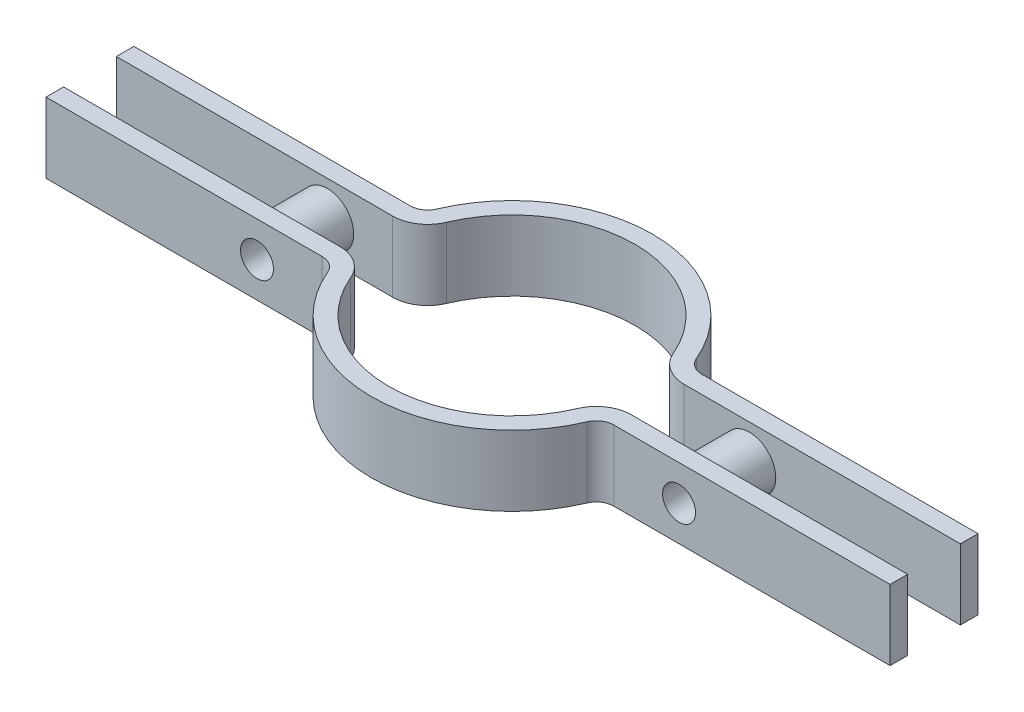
ISO-10303-21;
HEADER;
FILE_DESCRIPTION(('STEP AP214'),'2;1');
FILE_NAME('part.step','',(''),(''),'','','');
FILE_SCHEMA(('AUTOMOTIVE_DESIGN { 1 0 10303 214 1 1 1 1 }'));
ENDSEC;
DATA;
#1=APPLICATION_CONTEXT('core data for automotive mechanical design processes');
#2=APPLICATION_PROTOCOL_DEFINITION('international standard','automotive_design',2000,#1);
#3=PRODUCT_CONTEXT('',#1,'mechanical');
#4=PRODUCT('Part','Part','',(#3));
#5=PRODUCT_RELATED_PRODUCT_CATEGORY('part','',(#4));
#6=PRODUCT_DEFINITION_FORMATION('','',#4);
#7=PRODUCT_DEFINITION_CONTEXT('part definition',#1,'design');
#8=PRODUCT_DEFINITION('design','',#6,#7);
#9=PRODUCT_DEFINITION_SHAPE('','',#8);
#10=(LENGTH_UNIT() NAMED_UNIT(*) SI_UNIT(.MILLI.,.METRE.));
#11=(NAMED_UNIT(*) PLANE_ANGLE_UNIT() SI_UNIT($,.RADIAN.));
#12=(NAMED_UNIT(*) SI_UNIT($,.STERADIAN.) SOLID_ANGLE_UNIT());
#13=UNCERTAINTY_MEASURE_WITH_UNIT(LENGTH_MEASURE(1.E-05),#10,'distance_accuracy_value','');
#14=(GEOMETRIC_REPRESENTATION_CONTEXT(3) GLOBAL_UNCERTAINTY_ASSIGNED_CONTEXT((#13)) GLOBAL_UNIT_ASSIGNED_CONTEXT((#10,
#11,#12)) REPRESENTATION_CONTEXT('',''));
#15=CARTESIAN_POINT('',(0.,0.,0.));
#16=DIRECTION('',(0.,0.,1.));
#17=DIRECTION('',(1.,0.,0.));
#18=AXIS2_PLACEMENT_3D('',#15,#16,#17);
#19=CARTESIAN_POINT('',(52.651418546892,25.4,-9.525));
#20=DIRECTION('',(0.,0.,-1.));
#21=DIRECTION('',(-1.,0.,0.));
#22=AXIS2_PLACEMENT_3D('',#19,#20,#21);
#23=PLANE('',#22);
#24=DIRECTION('',(1.,0.,0.));
#25=VECTOR('',#24,1.);
#26=CARTESIAN_POINT('',(52.651418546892,0.,-9.525));
#27=LINE('',#26,#25);
#28=CARTESIAN_POINT('',(52.651418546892,0.,-9.52500000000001));
#29=VERTEX_POINT('',#28);
#30=CARTESIAN_POINT('',(152.4,0.,-9.525));
#31=VERTEX_POINT('',#30);
#32=EDGE_CURVE('E161',#29,#31,#27,.T.);
#33=ORIENTED_EDGE('',*,*,#32,.T.);
#34=DIRECTION('',(0.,-1.,0.));
#35=VECTOR('',#34,1.);
#36=CARTESIAN_POINT('',(152.4,25.4,-9.525));
#37=LINE('',#36,#35);
#38=CARTESIAN_POINT('',(152.4,25.4,-9.525));
#39=VERTEX_POINT('',#38);
#40=EDGE_CURVE('E208',#39,#31,#37,.T.);
#41=ORIENTED_EDGE('',*,*,#40,.F.);
#42=DIRECTION('',(1.,0.,0.));
#43=VECTOR('',#42,1.);
#44=CARTESIAN_POINT('',(52.651418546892,25.4,-9.525));
#45=LINE('',#44,#43);
#46=CARTESIAN_POINT('',(52.651418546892,25.4,-9.52500000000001));
#47=VERTEX_POINT('',#46);
#48=EDGE_CURVE('E106',#47,#39,#45,.T.);
#49=ORIENTED_EDGE('',*,*,#48,.F.);
#50=DIRECTION('',(0.,-1.,0.));
#51=VECTOR('',#50,1.);
#52=CARTESIAN_POINT('',(52.651418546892,25.4,-9.52500000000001));
#53=LINE('',#52,#51);
#54=EDGE_CURVE('E157',#47,#29,#53,.T.);
#55=ORIENTED_EDGE('',*,*,#54,.T.);
#56=EDGE_LOOP('',(#33,#41,#49,#55));
#57=FACE_BOUND('',#56,.T.);
#58=CARTESIAN_POINT('',(76.2,12.7,-9.525));
#59=DIRECTION('',(0.,0.,-1.));
#60=DIRECTION('',(-1.,0.,0.));
#61=AXIS2_PLACEMENT_3D('',#58,#59,#60);
#62=CIRCLE('',#61,9.52500000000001);
#63=CARTESIAN_POINT('',(85.725,12.7,-9.52499999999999));
#64=VERTEX_POINT('',#63);
#65=EDGE_CURVE('E11',#64,#64,#62,.F.);
#66=ORIENTED_EDGE('',*,*,#65,.F.);
#67=EDGE_LOOP('',(#66));
#68=FACE_BOUND('',#67,.T.);
#69=ADVANCED_FACE('F34',(#57,#68),#23,.F.);
#70=CARTESIAN_POINT('',(52.651418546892,25.4,9.525));
#71=DIRECTION('',(0.,0.,1.));
#72=DIRECTION('',(-1.,0.,0.));
#73=AXIS2_PLACEMENT_3D('',#70,#71,#72);
#74=PLANE('',#73);
#75=DIRECTION('',(1.,0.,0.));
#76=VECTOR('',#75,1.);
#77=CARTESIAN_POINT('',(52.651418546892,0.,9.525));
#78=LINE('',#77,#76);
#79=CARTESIAN_POINT('',(52.651418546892,0.,9.52500000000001));
#80=VERTEX_POINT('',#79);
#81=CARTESIAN_POINT('',(152.4,0.,9.525));
#82=VERTEX_POINT('',#81);
#83=EDGE_CURVE('E475',#80,#82,#78,.T.);
#84=ORIENTED_EDGE('',*,*,#83,.F.);
#85=DIRECTION('',(0.,-1.,0.));
#86=VECTOR('',#85,1.);
#87=CARTESIAN_POINT('',(52.651418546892,25.4,9.52500000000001));
#88=LINE('',#87,#86);
#89=CARTESIAN_POINT('',(52.651418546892,25.4,9.52500000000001));
#90=VERTEX_POINT('',#89);
#91=EDGE_CURVE('E513',#90,#80,#88,.T.);
#92=ORIENTED_EDGE('',*,*,#91,.F.);
#93=DIRECTION('',(1.,0.,0.));
#94=VECTOR('',#93,1.);
#95=CARTESIAN_POINT('',(52.651418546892,25.4,9.525));
#96=LINE('',#95,#94);
#97=CARTESIAN_POINT('',(152.4,25.4,9.525));
#98=VERTEX_POINT('',#97);
#99=EDGE_CURVE('E477',#90,#98,#96,.T.);
#100=ORIENTED_EDGE('',*,*,#99,.T.);
#101=DIRECTION('',(0.,-1.,0.));
#102=VECTOR('',#101,1.);
#103=CARTESIAN_POINT('',(152.4,25.4,9.525));
#104=LINE('',#103,#102);
#105=EDGE_CURVE('E213',#98,#82,#104,.T.);
#106=ORIENTED_EDGE('',*,*,#105,.T.);
#107=EDGE_LOOP('',(#84,#92,#100,#106));
#108=FACE_BOUND('',#107,.T.);
#109=CARTESIAN_POINT('',(76.2,12.7,9.525));
#110=DIRECTION('',(0.,0.,1.));
#111=DIRECTION('',(1.,0.,0.));
#112=AXIS2_PLACEMENT_3D('',#109,#110,#111);
#113=CIRCLE('',#112,9.52500000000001);
#114=CARTESIAN_POINT('',(85.725,12.7,9.52499999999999));
#115=VERTEX_POINT('',#114);
#116=EDGE_CURVE('E43',#115,#115,#113,.F.);
#117=ORIENTED_EDGE('',*,*,#116,.F.);
#118=EDGE_LOOP('',(#117));
#119=FACE_BOUND('',#118,.T.);
#120=ADVANCED_FACE('F276',(#108,#119),#74,.F.);
#121=CARTESIAN_POINT('',(-76.2,12.7,-42.8157683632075));
#122=DIRECTION('',(0.,0.,1.));
#123=DIRECTION('',(1.,0.,0.));
#124=AXIS2_PLACEMENT_3D('',#121,#122,#123);
#125=CYLINDRICAL_SURFACE('',#124,9.52500000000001);
#126=CARTESIAN_POINT('',(-76.2,12.7,-9.525));
#127=DIRECTION('',(0.,0.,-1.));
#128=DIRECTION('',(-1.,0.,0.));
#129=AXIS2_PLACEMENT_3D('',#126,#127,#128);
#130=CIRCLE('',#129,9.52500000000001);
#131=CARTESIAN_POINT('',(-66.675,12.7,-9.52500000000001));
#132=VERTEX_POINT('',#131);
#133=EDGE_CURVE('E165',#132,#132,#130,.T.);
#134=CARTESIAN_POINT('',(-76.2,12.7,9.525));
#135=DIRECTION('',(0.,0.,1.));
#136=DIRECTION('',(1.,0.,0.));
#137=AXIS2_PLACEMENT_3D('',#134,#135,#136);
#138=CIRCLE('',#137,9.52500000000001);
#139=CARTESIAN_POINT('',(-66.675,12.7,9.52500000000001));
#140=VERTEX_POINT('',#139);
#141=EDGE_CURVE('E37',#140,#140,#138,.F.);
#142=CARTESIAN_POINT('',(-66.675,12.7,-9.52500000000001));
#143=CARTESIAN_POINT('',(-66.675,12.7,-9.3265625));
#144=CARTESIAN_POINT('',(-66.675,12.7,-9.12812500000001));
#145=CARTESIAN_POINT('',(-66.675,12.7,-8.73125));
#146=CARTESIAN_POINT('',(-66.675,12.7,-8.53281250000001));
#147=CARTESIAN_POINT('',(-66.675,12.7,-8.1359375));
#148=CARTESIAN_POINT('',(-66.675,12.7,-7.93750000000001));
#149=CARTESIAN_POINT('',(-66.675,12.7,-7.540625));
#150=CARTESIAN_POINT('',(-66.675,12.7,-7.3421875));
#151=CARTESIAN_POINT('',(-66.675,12.7,-6.9453125));
#152=CARTESIAN_POINT('',(-66.675,12.7,-6.746875));
#153=CARTESIAN_POINT('',(-66.675,12.7,-6.35));
#154=CARTESIAN_POINT('',(-66.675,12.7,-6.1515625));
#155=CARTESIAN_POINT('',(-66.675,12.7,-5.7546875));
#156=CARTESIAN_POINT('',(-66.675,12.7,-5.55625));
#157=CARTESIAN_POINT('',(-66.675,12.7,-5.159375));
#158=CARTESIAN_POINT('',(-66.675,12.7,-4.9609375));
#159=CARTESIAN_POINT('',(-66.675,12.7,-4.5640625));
#160=CARTESIAN_POINT('',(-66.675,12.7,-4.365625));
#161=CARTESIAN_POINT('',(-66.675,12.7,-3.96875));
#162=CARTESIAN_POINT('',(-66.675,12.7,-3.7703125));
#163=CARTESIAN_POINT('',(-66.675,12.7,-3.3734375));
#164=CARTESIAN_POINT('',(-66.675,12.7,-3.175));
#165=CARTESIAN_POINT('',(-66.675,12.7,-2.778125));
#166=CARTESIAN_POINT('',(-66.675,12.7,-2.5796875));
#167=CARTESIAN_POINT('',(-66.675,12.7,-2.1828125));
#168=CARTESIAN_POINT('',(-66.675,12.7,-1.984375));
#169=CARTESIAN_POINT('',(-66.675,12.7,-1.5875));
#170=CARTESIAN_POINT('',(-66.675,12.7,-1.3890625));
#171=CARTESIAN_POINT('',(-66.675,12.7,-0.992187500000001));
#172=CARTESIAN_POINT('',(-66.675,12.7,-0.793750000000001));
#173=CARTESIAN_POINT('',(-66.675,12.7,-0.396875));
#174=CARTESIAN_POINT('',(-66.675,12.7,-0.1984375));
#175=CARTESIAN_POINT('',(-66.675,12.7,0.1984375));
#176=CARTESIAN_POINT('',(-66.675,12.7,0.396875));
#177=CARTESIAN_POINT('',(-66.675,12.7,0.793750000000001));
#178=CARTESIAN_POINT('',(-66.675,12.7,0.992187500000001));
#179=CARTESIAN_POINT('',(-66.675,12.7,1.3890625));
#180=CARTESIAN_POINT('',(-66.675,12.7,1.5875));
#181=CARTESIAN_POINT('',(-66.675,12.7,1.984375));
#182=CARTESIAN_POINT('',(-66.675,12.7,2.1828125));
#183=CARTESIAN_POINT('',(-66.675,12.7,2.5796875));
#184=CARTESIAN_POINT('',(-66.675,12.7,2.778125));
#185=CARTESIAN_POINT('',(-66.675,12.7,3.175));
#186=CARTESIAN_POINT('',(-66.675,12.7,3.3734375));
#187=CARTESIAN_POINT('',(-66.675,12.7,3.7703125));
#188=CARTESIAN_POINT('',(-66.675,12.7,3.96875));
#189=CARTESIAN_POINT('',(-66.675,12.7,4.365625));
#190=CARTESIAN_POINT('',(-66.675,12.7,4.5640625));
#191=CARTESIAN_POINT('',(-66.675,12.7,4.9609375));
#192=CARTESIAN_POINT('',(-66.675,12.7,5.159375));
#193=CARTESIAN_POINT('',(-66.675,12.7,5.55625));
#194=CARTESIAN_POINT('',(-66.675,12.7,5.7546875));
#195=CARTESIAN_POINT('',(-66.675,12.7,6.1515625));
#196=CARTESIAN_POINT('',(-66.675,12.7,6.35));
#197=CARTESIAN_POINT('',(-66.675,12.7,6.746875));
#198=CARTESIAN_POINT('',(-66.675,12.7,6.9453125));
#199=CARTESIAN_POINT('',(-66.675,12.7,7.3421875));
#200=CARTESIAN_POINT('',(-66.675,12.7,7.540625));
#201=CARTESIAN_POINT('',(-66.675,12.7,7.93750000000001));
#202=CARTESIAN_POINT('',(-66.675,12.7,8.1359375));
#203=CARTESIAN_POINT('',(-66.675,12.7,8.53281250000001));
#204=CARTESIAN_POINT('',(-66.675,12.7,8.73125));
#205=CARTESIAN_POINT('',(-66.675,12.7,9.12812500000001));
#206=CARTESIAN_POINT('',(-66.675,12.7,9.3265625));
#207=CARTESIAN_POINT('',(-66.675,12.7,9.52500000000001));
#208=B_SPLINE_CURVE_WITH_KNOTS('',3,(#142,#143,#144,#145,#146,#147,#148,#149,#150,#151,#152,
#153,#154,#155,#156,#157,#158,#159,#160,#161,#162,#163,#164,#165,#166,#167,#168,#169,#170,#171,
#172,#173,#174,#175,#176,#177,#178,#179,#180,#181,#182,#183,#184,#185,#186,#187,#188,#189,#190,
#191,#192,#193,#194,#195,#196,#197,#198,#199,#200,#201,#202,#203,#204,#205,#206,#207),
.UNSPECIFIED.,.F.,.F.,(4,2,2,2,2,2,2,2,2,2,2,2,2,2,2,2,2,2,2,2,2,2,2,2,2,2,2,2,2,2,2,2,4),(0.,
0.5953125,1.190625,1.7859375,2.38125,2.9765625,3.571875,4.1671875,4.7625,5.3578125,5.953125,
6.5484375,7.14375,7.7390625,8.334375,8.92968750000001,9.52500000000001,10.1203125,10.715625,
11.3109375,11.90625,12.5015625,13.096875,13.6921875,14.2875,14.8828125,15.478125,16.0734375,
16.66875,17.2640625,17.859375,18.4546875,19.05),.UNSPECIFIED.);
#209=EDGE_CURVE('BSEAM281',#132,#140,#208,.T.);
#210=ORIENTED_EDGE('',*,*,#133,.F.);
#211=ORIENTED_EDGE('',*,*,#141,.T.);
#212=ORIENTED_EDGE('',*,*,#209,.T.);
#213=ORIENTED_EDGE('',*,*,#209,.F.);
#214=EDGE_LOOP('',(#210,#212,#211,#213));
#215=FACE_BOUND('',#214,.T.);
#216=ADVANCED_FACE('F281',(#215),#125,.T.);
#217=CARTESIAN_POINT('',(152.4,25.4,-15.875));
#218=DIRECTION('',(1.,0.,0.));
#219=DIRECTION('',(0.,0.,-1.));
#220=AXIS2_PLACEMENT_3D('',#217,#218,#219);
#221=PLANE('',#220);
#222=DIRECTION('',(0.,0.,1.));
#223=VECTOR('',#222,1.);
#224=CARTESIAN_POINT('',(152.4,0.,-15.875));
#225=LINE('',#224,#223);
#226=CARTESIAN_POINT('',(152.4,0.,-15.875));
#227=VERTEX_POINT('',#226);
#228=EDGE_CURVE('E164',#227,#31,#225,.T.);
#229=ORIENTED_EDGE('',*,*,#228,.F.);
#230=DIRECTION('',(0.,-1.,0.));
#231=VECTOR('',#230,1.);
#232=CARTESIAN_POINT('',(152.4,25.4,-15.875));
#233=LINE('',#232,#231);
#234=CARTESIAN_POINT('',(152.4,25.4,-15.875));
#235=VERTEX_POINT('',#234);
#236=EDGE_CURVE('E206',#235,#227,#233,.T.);
#237=ORIENTED_EDGE('',*,*,#236,.F.);
#238=DIRECTION('',(0.,0.,1.));
#239=VECTOR('',#238,1.);
#240=CARTESIAN_POINT('',(152.4,25.4,-15.875));
#241=LINE('',#240,#239);
#242=EDGE_CURVE('E231',#235,#39,#241,.T.);
#243=ORIENTED_EDGE('',*,*,#242,.T.);
#244=ORIENTED_EDGE('',*,*,#40,.T.);
#245=EDGE_LOOP('',(#229,#237,#243,#244));
#246=FACE_BOUND('',#245,.T.);
#247=ADVANCED_FACE('F354',(#246),#221,.T.);
#248=CARTESIAN_POINT('',(52.651418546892,25.4,-15.875));
#249=DIRECTION('',(0.,0.,-1.));
#250=DIRECTION('',(-1.,0.,0.));
#251=AXIS2_PLACEMENT_3D('',#248,#249,#250);
#252=PLANE('',#251);
#253=CARTESIAN_POINT('',(76.2,12.7,-15.875));
#254=DIRECTION('',(0.,0.,-1.));
#255=DIRECTION('',(-1.,0.,0.));
#256=AXIS2_PLACEMENT_3D('',#253,#254,#255);
#257=CIRCLE('',#256,5.95248999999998);
#258=CARTESIAN_POINT('',(70.24751,12.7,-15.875));
#259=VERTEX_POINT('',#258);
#260=EDGE_CURVE('E472',#259,#259,#257,.T.);
#261=ORIENTED_EDGE('',*,*,#260,.F.);
#262=EDGE_LOOP('',(#261));
#263=FACE_BOUND('',#262,.T.);
#264=DIRECTION('',(1.,0.,0.));
#265=VECTOR('',#264,1.);
#266=CARTESIAN_POINT('',(52.651418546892,0.,-15.875));
#267=LINE('',#266,#265);
#268=CARTESIAN_POINT('',(52.651418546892,0.,-15.875));
#269=VERTEX_POINT('',#268);
#270=EDGE_CURVE('E168',#269,#227,#267,.T.);
#271=ORIENTED_EDGE('',*,*,#270,.F.);
#272=DIRECTION('',(0.,-1.,0.));
#273=VECTOR('',#272,1.);
#274=CARTESIAN_POINT('',(52.651418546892,25.4,-15.875));
#275=LINE('',#274,#273);
#276=CARTESIAN_POINT('',(52.651418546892,25.4,-15.875));
#277=VERTEX_POINT('',#276);
#278=EDGE_CURVE('E204',#277,#269,#275,.T.);
#279=ORIENTED_EDGE('',*,*,#278,.F.);
#280=DIRECTION('',(1.,0.,0.));
#281=VECTOR('',#280,1.);
#282=CARTESIAN_POINT('',(52.651418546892,25.4,-15.875));
#283=LINE('',#282,#281);
#284=EDGE_CURVE('E234',#277,#235,#283,.T.);
#285=ORIENTED_EDGE('',*,*,#284,.T.);
#286=ORIENTED_EDGE('',*,*,#236,.T.);
#287=EDGE_LOOP('',(#271,#279,#285,#286));
#288=FACE_BOUND('',#287,.T.);
#289=ADVANCED_FACE('F658',(#263,#288),#252,.T.);
#290=CARTESIAN_POINT('',(52.651418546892,25.4,-22.225));
#291=DIRECTION('',(0.,-1.,0.));
#292=DIRECTION('',(0.,0.,-1.));
#293=AXIS2_PLACEMENT_3D('',#290,#291,#292);
#294=CYLINDRICAL_SURFACE('',#293,6.35);
#295=CARTESIAN_POINT('',(52.651418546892,0.,-22.225));
#296=DIRECTION('',(0.,1.,0.));
#297=DIRECTION('',(1.,0.,0.));
#298=AXIS2_PLACEMENT_3D('',#295,#296,#297);
#299=CIRCLE('',#298,6.35);
#300=CARTESIAN_POINT('',(46.8012609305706,0.,-19.7555555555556));
#301=VERTEX_POINT('',#300);
#302=EDGE_CURVE('E171',#301,#269,#299,.T.);
#303=ORIENTED_EDGE('',*,*,#302,.F.);
#304=DIRECTION('',(0.,-1.,0.));
#305=VECTOR('',#304,1.);
#306=CARTESIAN_POINT('',(46.8012609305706,25.4,-19.7555555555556));
#307=LINE('',#306,#305);
#308=CARTESIAN_POINT('',(46.8012609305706,25.4,-19.7555555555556));
#309=VERTEX_POINT('',#308);
#310=EDGE_CURVE('E202',#309,#301,#307,.T.);
#311=ORIENTED_EDGE('',*,*,#310,.F.);
#312=CARTESIAN_POINT('',(52.651418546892,25.4,-22.225));
#313=DIRECTION('',(0.,1.,0.));
#314=DIRECTION('',(1.,0.,0.));
#315=AXIS2_PLACEMENT_3D('',#312,#313,#314);
#316=CIRCLE('',#315,6.35);
#317=EDGE_CURVE('E237',#309,#277,#316,.T.);
#318=ORIENTED_EDGE('',*,*,#317,.T.);
#319=ORIENTED_EDGE('',*,*,#278,.T.);
#320=EDGE_LOOP('',(#303,#311,#318,#319));
#321=FACE_BOUND('',#320,.T.);
#322=ADVANCED_FACE('F661',(#321),#294,.F.);
#323=CARTESIAN_POINT('',(0.,25.4,0.));
#324=DIRECTION('',(0.,-1.,0.));
#325=DIRECTION('',(0.,0.,-1.));
#326=AXIS2_PLACEMENT_3D('',#323,#324,#325);
#327=CYLINDRICAL_SURFACE('',#326,50.8);
#328=CARTESIAN_POINT('',(0.,0.,0.));
#329=DIRECTION('',(0.,1.,0.));
#330=DIRECTION('',(1.,0.,0.));
#331=AXIS2_PLACEMENT_3D('',#328,#329,#330);
#332=CIRCLE('',#331,50.8);
#333=CARTESIAN_POINT('',(-46.8012609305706,0.,-19.7555555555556));
#334=VERTEX_POINT('',#333);
#335=EDGE_CURVE('E174',#334,#301,#332,.F.);
#336=ORIENTED_EDGE('',*,*,#335,.F.);
#337=DIRECTION('',(0.,-1.,0.));
#338=VECTOR('',#337,1.);
#339=CARTESIAN_POINT('',(-46.8012609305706,25.4,-19.7555555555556));
#340=LINE('',#339,#338);
#341=CARTESIAN_POINT('',(-46.8012609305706,25.4,-19.7555555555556));
#342=VERTEX_POINT('',#341);
#343=EDGE_CURVE('E200',#342,#334,#340,.T.);
#344=ORIENTED_EDGE('',*,*,#343,.F.);
#345=CARTESIAN_POINT('',(0.,25.4,0.));
#346=DIRECTION('',(0.,1.,0.));
#347=DIRECTION('',(1.,0.,0.));
#348=AXIS2_PLACEMENT_3D('',#345,#346,#347);
#349=CIRCLE('',#348,50.8);
#350=EDGE_CURVE('E240',#342,#309,#349,.F.);
#351=ORIENTED_EDGE('',*,*,#350,.T.);
#352=ORIENTED_EDGE('',*,*,#310,.T.);
#353=EDGE_LOOP('',(#336,#344,#351,#352));
#354=FACE_BOUND('',#353,.T.);
#355=ADVANCED_FACE('F671',(#354),#327,.T.);
#356=CARTESIAN_POINT('',(-52.651418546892,25.4,-22.225));
#357=DIRECTION('',(0.,-1.,0.));
#358=DIRECTION('',(0.,0.,-1.));
#359=AXIS2_PLACEMENT_3D('',#356,#357,#358);
#360=CYLINDRICAL_SURFACE('',#359,6.35);
#361=CARTESIAN_POINT('',(-52.651418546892,0.,-22.225));
#362=DIRECTION('',(0.,1.,0.));
#363=DIRECTION('',(1.,0.,0.));
#364=AXIS2_PLACEMENT_3D('',#361,#362,#363);
#365=CIRCLE('',#364,6.35);
#366=CARTESIAN_POINT('',(-52.651418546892,0.,-15.875));
#367=VERTEX_POINT('',#366);
#368=EDGE_CURVE('E177',#367,#334,#365,.T.);
#369=ORIENTED_EDGE('',*,*,#368,.F.);
#370=DIRECTION('',(0.,-1.,0.));
#371=VECTOR('',#370,1.);
#372=CARTESIAN_POINT('',(-52.651418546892,25.4,-15.875));
#373=LINE('',#372,#371);
#374=CARTESIAN_POINT('',(-52.651418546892,25.4,-15.875));
#375=VERTEX_POINT('',#374);
#376=EDGE_CURVE('E198',#375,#367,#373,.T.);
#377=ORIENTED_EDGE('',*,*,#376,.F.);
#378=CARTESIAN_POINT('',(-52.651418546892,25.4,-22.225));
#379=DIRECTION('',(0.,1.,0.));
#380=DIRECTION('',(1.,0.,0.));
#381=AXIS2_PLACEMENT_3D('',#378,#379,#380);
#382=CIRCLE('',#381,6.35);
#383=EDGE_CURVE('E243',#375,#342,#382,.T.);
#384=ORIENTED_EDGE('',*,*,#383,.T.);
#385=ORIENTED_EDGE('',*,*,#343,.T.);
#386=EDGE_LOOP('',(#369,#377,#384,#385));
#387=FACE_BOUND('',#386,.T.);
#388=ADVANCED_FACE('F673',(#387),#360,.F.);
#389=CARTESIAN_POINT('',(-152.4,25.4,-15.875));
#390=DIRECTION('',(0.,0.,-1.));
#391=DIRECTION('',(-1.,0.,0.));
#392=AXIS2_PLACEMENT_3D('',#389,#390,#391);
#393=PLANE('',#392);
#394=CARTESIAN_POINT('',(-76.2,12.7,-15.875));
#395=DIRECTION('',(0.,0.,-1.));
#396=DIRECTION('',(-1.,0.,0.));
#397=AXIS2_PLACEMENT_3D('',#394,#395,#396);
#398=CIRCLE('',#397,5.95248999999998);
#399=CARTESIAN_POINT('',(-82.15249,12.7,-15.875));
#400=VERTEX_POINT('',#399);
#401=EDGE_CURVE('E462',#400,#400,#398,.T.);
#402=ORIENTED_EDGE('',*,*,#401,.F.);
#403=EDGE_LOOP('',(#402));
#404=FACE_BOUND('',#403,.T.);
#405=DIRECTION('',(1.,0.,0.));
#406=VECTOR('',#405,1.);
#407=CARTESIAN_POINT('',(-152.4,0.,-15.875));
#408=LINE('',#407,#406);
#409=CARTESIAN_POINT('',(-152.4,0.,-15.875));
#410=VERTEX_POINT('',#409);
#411=EDGE_CURVE('E180',#410,#367,#408,.T.);
#412=ORIENTED_EDGE('',*,*,#411,.F.);
#413=DIRECTION('',(0.,-1.,0.));
#414=VECTOR('',#413,1.);
#415=CARTESIAN_POINT('',(-152.4,25.4,-15.875));
#416=LINE('',#415,#414);
#417=CARTESIAN_POINT('',(-152.4,25.4,-15.875));
#418=VERTEX_POINT('',#417);
#419=EDGE_CURVE('E196',#418,#410,#416,.T.);
#420=ORIENTED_EDGE('',*,*,#419,.F.);
#421=DIRECTION('',(1.,0.,0.));
#422=VECTOR('',#421,1.);
#423=CARTESIAN_POINT('',(-152.4,25.4,-15.875));
#424=LINE('',#423,#422);
#425=EDGE_CURVE('E246',#418,#375,#424,.T.);
#426=ORIENTED_EDGE('',*,*,#425,.T.);
#427=ORIENTED_EDGE('',*,*,#376,.T.);
#428=EDGE_LOOP('',(#412,#420,#426,#427));
#429=FACE_BOUND('',#428,.T.);
#430=ADVANCED_FACE('F259',(#404,#429),#393,.T.);
#431=CARTESIAN_POINT('',(-152.4,25.4,-9.525));
#432=DIRECTION('',(-1.,0.,0.));
#433=DIRECTION('',(0.,0.,1.));
#434=AXIS2_PLACEMENT_3D('',#431,#432,#433);
#435=PLANE('',#434);
#436=DIRECTION('',(0.,0.,-1.));
#437=VECTOR('',#436,1.);
#438=CARTESIAN_POINT('',(-152.4,0.,-9.525));
#439=LINE('',#438,#437);
#440=CARTESIAN_POINT('',(-152.4,0.,-9.525));
#441=VERTEX_POINT('',#440);
#442=EDGE_CURVE('E183',#441,#410,#439,.T.);
#443=ORIENTED_EDGE('',*,*,#442,.F.);
#444=DIRECTION('',(0.,-1.,0.));
#445=VECTOR('',#444,1.);
#446=CARTESIAN_POINT('',(-152.4,25.4,-9.525));
#447=LINE('',#446,#445);
#448=CARTESIAN_POINT('',(-152.4,25.4,-9.525));
#449=VERTEX_POINT('',#448);
#450=EDGE_CURVE('E194',#449,#441,#447,.T.);
#451=ORIENTED_EDGE('',*,*,#450,.F.);
#452=DIRECTION('',(0.,0.,-1.));
#453=VECTOR('',#452,1.);
#454=CARTESIAN_POINT('',(-152.4,25.4,-9.525));
#455=LINE('',#454,#453);
#456=EDGE_CURVE('E249',#449,#418,#455,.T.);
#457=ORIENTED_EDGE('',*,*,#456,.T.);
#458=ORIENTED_EDGE('',*,*,#419,.T.);
#459=EDGE_LOOP('',(#443,#451,#457,#458));
#460=FACE_BOUND('',#459,.T.);
#461=ADVANCED_FACE('F253',(#460),#435,.T.);
#462=CARTESIAN_POINT('',(-152.4,25.4,-9.525));
#463=DIRECTION('',(0.,0.,-1.));
#464=DIRECTION('',(-1.,0.,0.));
#465=AXIS2_PLACEMENT_3D('',#462,#463,#464);
#466=PLANE('',#465);
#467=ORIENTED_EDGE('',*,*,#133,.T.);
#468=EDGE_LOOP('',(#467));
#469=FACE_BOUND('',#468,.T.);
#470=DIRECTION('',(1.,0.,0.));
#471=VECTOR('',#470,1.);
#472=CARTESIAN_POINT('',(-152.4,0.,-9.525));
#473=LINE('',#472,#471);
#474=CARTESIAN_POINT('',(-52.651418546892,0.,-9.525));
#475=VERTEX_POINT('',#474);
#476=EDGE_CURVE('E186',#441,#475,#473,.T.);
#477=ORIENTED_EDGE('',*,*,#476,.T.);
#478=DIRECTION('',(0.,-1.,0.));
#479=VECTOR('',#478,1.);
#480=CARTESIAN_POINT('',(-52.651418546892,25.4,-9.525));
#481=LINE('',#480,#479);
#482=CARTESIAN_POINT('',(-52.651418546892,25.4,-9.525));
#483=VERTEX_POINT('',#482);
#484=EDGE_CURVE('E152',#483,#475,#481,.T.);
#485=ORIENTED_EDGE('',*,*,#484,.F.);
#486=DIRECTION('',(1.,0.,0.));
#487=VECTOR('',#486,1.);
#488=CARTESIAN_POINT('',(-152.4,25.4,-9.525));
#489=LINE('',#488,#487);
#490=EDGE_CURVE('E143',#449,#483,#489,.T.);
#491=ORIENTED_EDGE('',*,*,#490,.F.);
#492=ORIENTED_EDGE('',*,*,#450,.T.);
#493=EDGE_LOOP('',(#477,#485,#491,#492));
#494=FACE_BOUND('',#493,.T.);
#495=ADVANCED_FACE('F266',(#469,#494),#466,.F.);
#496=CARTESIAN_POINT('',(-52.651418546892,25.4,-22.225));
#497=DIRECTION('',(0.,-1.,0.));
#498=DIRECTION('',(0.,0.,-1.));
#499=AXIS2_PLACEMENT_3D('',#496,#497,#498);
#500=CYLINDRICAL_SURFACE('',#499,12.7);
#501=CARTESIAN_POINT('',(-52.651418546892,0.,-22.225));
#502=DIRECTION('',(0.,1.,0.));
#503=DIRECTION('',(0.,0.,1.));
#504=AXIS2_PLACEMENT_3D('',#501,#502,#503);
#505=CIRCLE('',#504,12.7);
#506=CARTESIAN_POINT('',(-40.9511033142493,0.,-17.2861111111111));
#507=VERTEX_POINT('',#506);
#508=EDGE_CURVE('E151',#475,#507,#505,.T.);
#509=ORIENTED_EDGE('',*,*,#508,.T.);
#510=DIRECTION('',(0.,-1.,0.));
#511=VECTOR('',#510,1.);
#512=CARTESIAN_POINT('',(-40.9511033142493,25.4,-17.2861111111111));
#513=LINE('',#512,#511);
#514=CARTESIAN_POINT('',(-40.9511033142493,25.4,-17.2861111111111));
#515=VERTEX_POINT('',#514);
#516=EDGE_CURVE('E148',#515,#507,#513,.T.);
#517=ORIENTED_EDGE('',*,*,#516,.F.);
#518=CARTESIAN_POINT('',(-52.651418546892,25.4,-22.225));
#519=DIRECTION('',(0.,1.,0.));
#520=DIRECTION('',(0.,0.,1.));
#521=AXIS2_PLACEMENT_3D('',#518,#519,#520);
#522=CIRCLE('',#521,12.7);
#523=EDGE_CURVE('E136',#483,#515,#522,.T.);
#524=ORIENTED_EDGE('',*,*,#523,.F.);
#525=ORIENTED_EDGE('',*,*,#484,.T.);
#526=EDGE_LOOP('',(#509,#517,#524,#525));
#527=FACE_BOUND('',#526,.T.);
#528=ADVANCED_FACE('F149',(#527),#500,.T.);
#529=CARTESIAN_POINT('',(0.,25.4,0.));
#530=DIRECTION('',(0.,-1.,0.));
#531=DIRECTION('',(0.,0.,-1.));
#532=AXIS2_PLACEMENT_3D('',#529,#530,#531);
#533=CYLINDRICAL_SURFACE('',#532,44.45);
#534=CARTESIAN_POINT('',(0.,0.,0.));
#535=DIRECTION('',(0.,-1.,0.));
#536=DIRECTION('',(0.,0.,1.));
#537=AXIS2_PLACEMENT_3D('',#534,#535,#536);
#538=CIRCLE('',#537,44.45);
#539=CARTESIAN_POINT('',(40.9511033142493,0.,-17.2861111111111));
#540=VERTEX_POINT('',#539);
#541=EDGE_CURVE('E94',#507,#540,#538,.T.);
#542=ORIENTED_EDGE('',*,*,#541,.T.);
#543=DIRECTION('',(0.,-1.,0.));
#544=VECTOR('',#543,1.);
#545=CARTESIAN_POINT('',(40.9511033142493,25.4,-17.2861111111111));
#546=LINE('',#545,#544);
#547=CARTESIAN_POINT('',(40.9511033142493,25.4,-17.2861111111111));
#548=VERTEX_POINT('',#547);
#549=EDGE_CURVE('E153',#548,#540,#546,.T.);
#550=ORIENTED_EDGE('',*,*,#549,.F.);
#551=CARTESIAN_POINT('',(0.,25.4,0.));
#552=DIRECTION('',(0.,-1.,0.));
#553=DIRECTION('',(0.,0.,1.));
#554=AXIS2_PLACEMENT_3D('',#551,#552,#553);
#555=CIRCLE('',#554,44.45);
#556=EDGE_CURVE('E140',#515,#548,#555,.T.);
#557=ORIENTED_EDGE('',*,*,#556,.F.);
#558=ORIENTED_EDGE('',*,*,#516,.T.);
#559=EDGE_LOOP('',(#542,#550,#557,#558));
#560=FACE_BOUND('',#559,.T.);
#561=ADVANCED_FACE('F155',(#560),#533,.F.);
#562=CARTESIAN_POINT('',(52.651418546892,25.4,-22.225));
#563=DIRECTION('',(0.,-1.,0.));
#564=DIRECTION('',(0.,0.,-1.));
#565=AXIS2_PLACEMENT_3D('',#562,#563,#564);
#566=CYLINDRICAL_SURFACE('',#565,12.7);
#567=CARTESIAN_POINT('',(52.651418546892,0.,-22.225));
#568=DIRECTION('',(0.,1.,0.));
#569=DIRECTION('',(0.,0.,-1.));
#570=AXIS2_PLACEMENT_3D('',#567,#568,#569);
#571=CIRCLE('',#570,12.7);
#572=EDGE_CURVE('E100',#540,#29,#571,.T.);
#573=ORIENTED_EDGE('',*,*,#572,.T.);
#574=ORIENTED_EDGE('',*,*,#54,.F.);
#575=CARTESIAN_POINT('',(52.651418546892,25.4,-22.225));
#576=DIRECTION('',(0.,1.,0.));
#577=DIRECTION('',(0.,0.,-1.));
#578=AXIS2_PLACEMENT_3D('',#575,#576,#577);
#579=CIRCLE('',#578,12.7);
#580=EDGE_CURVE('E52',#548,#47,#579,.T.);
#581=ORIENTED_EDGE('',*,*,#580,.F.);
#582=ORIENTED_EDGE('',*,*,#549,.T.);
#583=EDGE_LOOP('',(#573,#574,#581,#582));
#584=FACE_BOUND('',#583,.T.);
#585=ADVANCED_FACE('F358',(#584),#566,.T.);
#586=CARTESIAN_POINT('',(52.651418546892,25.4,-22.225));
#587=DIRECTION('',(0.,1.,0.));
#588=DIRECTION('',(1.,0.,0.));
#589=AXIS2_PLACEMENT_3D('',#586,#587,#588);
#590=PLANE('',#589);
#591=ORIENTED_EDGE('',*,*,#48,.T.);
#592=ORIENTED_EDGE('',*,*,#242,.F.);
#593=ORIENTED_EDGE('',*,*,#284,.F.);
#594=ORIENTED_EDGE('',*,*,#317,.F.);
#595=ORIENTED_EDGE('',*,*,#350,.F.);
#596=ORIENTED_EDGE('',*,*,#383,.F.);
#597=ORIENTED_EDGE('',*,*,#425,.F.);
#598=ORIENTED_EDGE('',*,*,#456,.F.);
#599=ORIENTED_EDGE('',*,*,#490,.T.);
#600=ORIENTED_EDGE('',*,*,#523,.T.);
#601=ORIENTED_EDGE('',*,*,#556,.T.);
#602=ORIENTED_EDGE('',*,*,#580,.T.);
#603=EDGE_LOOP('',(#591,#592,#593,#594,#595,#596,#597,#598,#599,#600,#601,#602));
#604=FACE_BOUND('',#603,.T.);
#605=ADVANCED_FACE('F138',(#604),#590,.T.);
#606=CARTESIAN_POINT('',(52.651418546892,0.,-22.225));
#607=DIRECTION('',(0.,1.,0.));
#608=DIRECTION('',(1.,0.,0.));
#609=AXIS2_PLACEMENT_3D('',#606,#607,#608);
#610=PLANE('',#609);
#611=ORIENTED_EDGE('',*,*,#32,.F.);
#612=ORIENTED_EDGE('',*,*,#572,.F.);
#613=ORIENTED_EDGE('',*,*,#541,.F.);
#614=ORIENTED_EDGE('',*,*,#508,.F.);
#615=ORIENTED_EDGE('',*,*,#476,.F.);
#616=ORIENTED_EDGE('',*,*,#442,.T.);
#617=ORIENTED_EDGE('',*,*,#411,.T.);
#618=ORIENTED_EDGE('',*,*,#368,.T.);
#619=ORIENTED_EDGE('',*,*,#335,.T.);
#620=ORIENTED_EDGE('',*,*,#302,.T.);
#621=ORIENTED_EDGE('',*,*,#270,.T.);
#622=ORIENTED_EDGE('',*,*,#228,.T.);
#623=EDGE_LOOP('',(#611,#612,#613,#614,#615,#616,#617,#618,#619,#620,#621,#622));
#624=FACE_BOUND('',#623,.T.);
#625=ADVANCED_FACE('F264',(#624),#610,.F.);
#626=CARTESIAN_POINT('',(152.4,25.4,15.875));
#627=DIRECTION('',(1.,0.,0.));
#628=DIRECTION('',(0.,0.,1.));
#629=AXIS2_PLACEMENT_3D('',#626,#627,#628);
#630=PLANE('',#629);
#631=DIRECTION('',(0.,0.,-1.));
#632=VECTOR('',#631,1.);
#633=CARTESIAN_POINT('',(152.4,0.,15.875));
#634=LINE('',#633,#632);
#635=CARTESIAN_POINT('',(152.4,0.,15.875));
#636=VERTEX_POINT('',#635);
#637=EDGE_CURVE('E515',#636,#82,#634,.T.);
#638=ORIENTED_EDGE('',*,*,#637,.T.);
#639=ORIENTED_EDGE('',*,*,#105,.F.);
#640=DIRECTION('',(0.,0.,-1.));
#641=VECTOR('',#640,1.);
#642=CARTESIAN_POINT('',(152.4,25.4,15.875));
#643=LINE('',#642,#641);
#644=CARTESIAN_POINT('',(152.4,25.4,15.875));
#645=VERTEX_POINT('',#644);
#646=EDGE_CURVE('E479',#645,#98,#643,.T.);
#647=ORIENTED_EDGE('',*,*,#646,.F.);
#648=DIRECTION('',(0.,-1.,0.));
#649=VECTOR('',#648,1.);
#650=CARTESIAN_POINT('',(152.4,25.4,15.875));
#651=LINE('',#650,#649);
#652=EDGE_CURVE('E217',#645,#636,#651,.T.);
#653=ORIENTED_EDGE('',*,*,#652,.T.);
#654=EDGE_LOOP('',(#638,#639,#647,#653));
#655=FACE_BOUND('',#654,.T.);
#656=ADVANCED_FACE('F347',(#655),#630,.T.);
#657=CARTESIAN_POINT('',(52.651418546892,25.4,15.875));
#658=DIRECTION('',(0.,0.,1.));
#659=DIRECTION('',(-1.,0.,0.));
#660=AXIS2_PLACEMENT_3D('',#657,#658,#659);
#661=PLANE('',#660);
#662=CARTESIAN_POINT('',(76.2,12.7,15.875));
#663=DIRECTION('',(0.,0.,1.));
#664=DIRECTION('',(1.,0.,0.));
#665=AXIS2_PLACEMENT_3D('',#662,#663,#664);
#666=CIRCLE('',#665,5.95248999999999);
#667=CARTESIAN_POINT('',(82.15249,12.7,15.875));
#668=VERTEX_POINT('',#667);
#669=EDGE_CURVE('E467',#668,#668,#666,.T.);
#670=ORIENTED_EDGE('',*,*,#669,.F.);
#671=EDGE_LOOP('',(#670));
#672=FACE_BOUND('',#671,.T.);
#673=DIRECTION('',(1.,0.,0.));
#674=VECTOR('',#673,1.);
#675=CARTESIAN_POINT('',(52.651418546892,0.,15.875));
#676=LINE('',#675,#674);
#677=CARTESIAN_POINT('',(52.651418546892,0.,15.875));
#678=VERTEX_POINT('',#677);
#679=EDGE_CURVE('E518',#678,#636,#676,.T.);
#680=ORIENTED_EDGE('',*,*,#679,.T.);
#681=ORIENTED_EDGE('',*,*,#652,.F.);
#682=DIRECTION('',(1.,0.,0.));
#683=VECTOR('',#682,1.);
#684=CARTESIAN_POINT('',(52.651418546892,25.4,15.875));
#685=LINE('',#684,#683);
#686=CARTESIAN_POINT('',(52.651418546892,25.4,15.875));
#687=VERTEX_POINT('',#686);
#688=EDGE_CURVE('E483',#687,#645,#685,.T.);
#689=ORIENTED_EDGE('',*,*,#688,.F.);
#690=DIRECTION('',(0.,-1.,0.));
#691=VECTOR('',#690,1.);
#692=CARTESIAN_POINT('',(52.651418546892,25.4,15.875));
#693=LINE('',#692,#691);
#694=EDGE_CURVE('E226',#687,#678,#693,.T.);
#695=ORIENTED_EDGE('',*,*,#694,.T.);
#696=EDGE_LOOP('',(#680,#681,#689,#695));
#697=FACE_BOUND('',#696,.T.);
#698=ADVANCED_FACE('F343',(#672,#697),#661,.T.);
#699=CARTESIAN_POINT('',(52.651418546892,25.4,22.225));
#700=DIRECTION('',(0.,-1.,0.));
#701=DIRECTION('',(0.,0.,1.));
#702=AXIS2_PLACEMENT_3D('',#699,#700,#701);
#703=CYLINDRICAL_SURFACE('',#702,6.35);
#704=CARTESIAN_POINT('',(52.651418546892,0.,22.225));
#705=DIRECTION('',(0.,-1.,0.));
#706=DIRECTION('',(1.,0.,0.));
#707=AXIS2_PLACEMENT_3D('',#704,#705,#706);
#708=CIRCLE('',#707,6.35);
#709=CARTESIAN_POINT('',(46.8012609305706,0.,19.7555555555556));
#710=VERTEX_POINT('',#709);
#711=EDGE_CURVE('E521',#710,#678,#708,.T.);
#712=ORIENTED_EDGE('',*,*,#711,.T.);
#713=ORIENTED_EDGE('',*,*,#694,.F.);
#714=CARTESIAN_POINT('',(52.651418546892,25.4,22.225));
#715=DIRECTION('',(0.,-1.,0.));
#716=DIRECTION('',(1.,0.,0.));
#717=AXIS2_PLACEMENT_3D('',#714,#715,#716);
#718=CIRCLE('',#717,6.35);
#719=CARTESIAN_POINT('',(46.8012609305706,25.4,19.7555555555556));
#720=VERTEX_POINT('',#719);
#721=EDGE_CURVE('E486',#720,#687,#718,.T.);
#722=ORIENTED_EDGE('',*,*,#721,.F.);
#723=DIRECTION('',(0.,-1.,0.));
#724=VECTOR('',#723,1.);
#725=CARTESIAN_POINT('',(46.8012609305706,25.4,19.7555555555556));
#726=LINE('',#725,#724);
#727=EDGE_CURVE('E570',#720,#710,#726,.T.);
#728=ORIENTED_EDGE('',*,*,#727,.T.);
#729=EDGE_LOOP('',(#712,#713,#722,#728));
#730=FACE_BOUND('',#729,.T.);
#731=ADVANCED_FACE('F339',(#730),#703,.F.);
#732=CARTESIAN_POINT('',(0.,25.4,0.));
#733=DIRECTION('',(0.,-1.,0.));
#734=DIRECTION('',(0.,0.,1.));
#735=AXIS2_PLACEMENT_3D('',#732,#733,#734);
#736=CYLINDRICAL_SURFACE('',#735,50.8);
#737=CARTESIAN_POINT('',(0.,0.,0.));
#738=DIRECTION('',(0.,-1.,0.));
#739=DIRECTION('',(1.,0.,0.));
#740=AXIS2_PLACEMENT_3D('',#737,#738,#739);
#741=CIRCLE('',#740,50.8);
#742=CARTESIAN_POINT('',(-46.8012609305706,0.,19.7555555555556));
#743=VERTEX_POINT('',#742);
#744=EDGE_CURVE('E524',#743,#710,#741,.F.);
#745=ORIENTED_EDGE('',*,*,#744,.T.);
#746=ORIENTED_EDGE('',*,*,#727,.F.);
#747=CARTESIAN_POINT('',(0.,25.4,0.));
#748=DIRECTION('',(0.,-1.,0.));
#749=DIRECTION('',(1.,0.,0.));
#750=AXIS2_PLACEMENT_3D('',#747,#748,#749);
#751=CIRCLE('',#750,50.8);
#752=CARTESIAN_POINT('',(-46.8012609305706,25.4,19.7555555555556));
#753=VERTEX_POINT('',#752);
#754=EDGE_CURVE('E489',#753,#720,#751,.F.);
#755=ORIENTED_EDGE('',*,*,#754,.F.);
#756=DIRECTION('',(0.,-1.,0.));
#757=VECTOR('',#756,1.);
#758=CARTESIAN_POINT('',(-46.8012609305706,25.4,19.7555555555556));
#759=LINE('',#758,#757);
#760=EDGE_CURVE('E567',#753,#743,#759,.T.);
#761=ORIENTED_EDGE('',*,*,#760,.T.);
#762=EDGE_LOOP('',(#745,#746,#755,#761));
#763=FACE_BOUND('',#762,.T.);
#764=ADVANCED_FACE('F335',(#763),#736,.T.);
#765=CARTESIAN_POINT('',(-52.651418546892,25.4,22.225));
#766=DIRECTION('',(0.,-1.,0.));
#767=DIRECTION('',(0.,0.,1.));
#768=AXIS2_PLACEMENT_3D('',#765,#766,#767);
#769=CYLINDRICAL_SURFACE('',#768,6.35);
#770=CARTESIAN_POINT('',(-52.651418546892,0.,22.225));
#771=DIRECTION('',(0.,-1.,0.));
#772=DIRECTION('',(1.,0.,0.));
#773=AXIS2_PLACEMENT_3D('',#770,#771,#772);
#774=CIRCLE('',#773,6.35);
#775=CARTESIAN_POINT('',(-52.651418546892,0.,15.875));
#776=VERTEX_POINT('',#775);
#777=EDGE_CURVE('E527',#776,#743,#774,.T.);
#778=ORIENTED_EDGE('',*,*,#777,.T.);
#779=ORIENTED_EDGE('',*,*,#760,.F.);
#780=CARTESIAN_POINT('',(-52.651418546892,25.4,22.225));
#781=DIRECTION('',(0.,-1.,0.));
#782=DIRECTION('',(1.,0.,0.));
#783=AXIS2_PLACEMENT_3D('',#780,#781,#782);
#784=CIRCLE('',#783,6.35);
#785=CARTESIAN_POINT('',(-52.651418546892,25.4,15.875));
#786=VERTEX_POINT('',#785);
#787=EDGE_CURVE('E492',#786,#753,#784,.T.);
#788=ORIENTED_EDGE('',*,*,#787,.F.);
#789=DIRECTION('',(0.,-1.,0.));
#790=VECTOR('',#789,1.);
#791=CARTESIAN_POINT('',(-52.651418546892,25.4,15.875));
#792=LINE('',#791,#790);
#793=EDGE_CURVE('E564',#786,#776,#792,.T.);
#794=ORIENTED_EDGE('',*,*,#793,.T.);
#795=EDGE_LOOP('',(#778,#779,#788,#794));
#796=FACE_BOUND('',#795,.T.);
#797=ADVANCED_FACE('F331',(#796),#769,.F.);
#798=CARTESIAN_POINT('',(-152.4,25.4,9.525));
#799=DIRECTION('',(-1.,0.,0.));
#800=DIRECTION('',(0.,0.,-1.));
#801=AXIS2_PLACEMENT_3D('',#798,#799,#800);
#802=PLANE('',#801);
#803=DIRECTION('',(0.,0.,1.));
#804=VECTOR('',#803,1.);
#805=CARTESIAN_POINT('',(-152.4,0.,9.525));
#806=LINE('',#805,#804);
#807=CARTESIAN_POINT('',(-152.4,0.,9.525));
#808=VERTEX_POINT('',#807);
#809=CARTESIAN_POINT('',(-152.4,0.,15.875));
#810=VERTEX_POINT('',#809);
#811=EDGE_CURVE('E533',#808,#810,#806,.T.);
#812=ORIENTED_EDGE('',*,*,#811,.T.);
#813=DIRECTION('',(0.,-1.,0.));
#814=VECTOR('',#813,1.);
#815=CARTESIAN_POINT('',(-152.4,25.4,15.875));
#816=LINE('',#815,#814);
#817=CARTESIAN_POINT('',(-152.4,25.4,15.875));
#818=VERTEX_POINT('',#817);
#819=EDGE_CURVE('E561',#818,#810,#816,.T.);
#820=ORIENTED_EDGE('',*,*,#819,.F.);
#821=DIRECTION('',(0.,0.,1.));
#822=VECTOR('',#821,1.);
#823=CARTESIAN_POINT('',(-152.4,25.4,9.525));
#824=LINE('',#823,#822);
#825=CARTESIAN_POINT('',(-152.4,25.4,9.525));
#826=VERTEX_POINT('',#825);
#827=EDGE_CURVE('E498',#826,#818,#824,.T.);
#828=ORIENTED_EDGE('',*,*,#827,.F.);
#829=DIRECTION('',(0.,-1.,0.));
#830=VECTOR('',#829,1.);
#831=CARTESIAN_POINT('',(-152.4,25.4,9.525));
#832=LINE('',#831,#830);
#833=EDGE_CURVE('E558',#826,#808,#832,.T.);
#834=ORIENTED_EDGE('',*,*,#833,.T.);
#835=EDGE_LOOP('',(#812,#820,#828,#834));
#836=FACE_BOUND('',#835,.T.);
#837=ADVANCED_FACE('F327',(#836),#802,.T.);
#838=CARTESIAN_POINT('',(-152.4,25.4,9.525));
#839=DIRECTION('',(0.,0.,1.));
#840=DIRECTION('',(-1.,0.,0.));
#841=AXIS2_PLACEMENT_3D('',#838,#839,#840);
#842=PLANE('',#841);
#843=ORIENTED_EDGE('',*,*,#141,.F.);
#844=EDGE_LOOP('',(#843));
#845=FACE_BOUND('',#844,.T.);
#846=DIRECTION('',(1.,0.,0.));
#847=VECTOR('',#846,1.);
#848=CARTESIAN_POINT('',(-152.4,0.,9.525));
#849=LINE('',#848,#847);
#850=CARTESIAN_POINT('',(-52.651418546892,0.,9.525));
#851=VERTEX_POINT('',#850);
#852=EDGE_CURVE('E536',#808,#851,#849,.T.);
#853=ORIENTED_EDGE('',*,*,#852,.F.);
#854=ORIENTED_EDGE('',*,*,#833,.F.);
#855=DIRECTION('',(1.,0.,0.));
#856=VECTOR('',#855,1.);
#857=CARTESIAN_POINT('',(-152.4,25.4,9.525));
#858=LINE('',#857,#856);
#859=CARTESIAN_POINT('',(-52.651418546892,25.4,9.525));
#860=VERTEX_POINT('',#859);
#861=EDGE_CURVE('E501',#826,#860,#858,.T.);
#862=ORIENTED_EDGE('',*,*,#861,.T.);
#863=DIRECTION('',(0.,-1.,0.));
#864=VECTOR('',#863,1.);
#865=CARTESIAN_POINT('',(-52.651418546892,25.4,9.525));
#866=LINE('',#865,#864);
#867=EDGE_CURVE('E555',#860,#851,#866,.T.);
#868=ORIENTED_EDGE('',*,*,#867,.T.);
#869=EDGE_LOOP('',(#853,#854,#862,#868));
#870=FACE_BOUND('',#869,.T.);
#871=ADVANCED_FACE('F323',(#845,#870),#842,.F.);
#872=CARTESIAN_POINT('',(-52.651418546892,25.4,22.225));
#873=DIRECTION('',(0.,-1.,0.));
#874=DIRECTION('',(0.,0.,1.));
#875=AXIS2_PLACEMENT_3D('',#872,#873,#874);
#876=CYLINDRICAL_SURFACE('',#875,12.7);
#877=CARTESIAN_POINT('',(-52.651418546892,0.,22.225));
#878=DIRECTION('',(0.,-1.,0.));
#879=DIRECTION('',(0.,0.,-1.));
#880=AXIS2_PLACEMENT_3D('',#877,#878,#879);
#881=CIRCLE('',#880,12.7);
#882=CARTESIAN_POINT('',(-40.9511033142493,0.,17.2861111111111));
#883=VERTEX_POINT('',#882);
#884=EDGE_CURVE('E539',#851,#883,#881,.T.);
#885=ORIENTED_EDGE('',*,*,#884,.F.);
#886=ORIENTED_EDGE('',*,*,#867,.F.);
#887=CARTESIAN_POINT('',(-52.651418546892,25.4,22.225));
#888=DIRECTION('',(0.,-1.,0.));
#889=DIRECTION('',(0.,0.,-1.));
#890=AXIS2_PLACEMENT_3D('',#887,#888,#889);
#891=CIRCLE('',#890,12.7);
#892=CARTESIAN_POINT('',(-40.9511033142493,25.4,17.2861111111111));
#893=VERTEX_POINT('',#892);
#894=EDGE_CURVE('E504',#860,#893,#891,.T.);
#895=ORIENTED_EDGE('',*,*,#894,.T.);
#896=DIRECTION('',(0.,-1.,0.));
#897=VECTOR('',#896,1.);
#898=CARTESIAN_POINT('',(-40.9511033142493,25.4,17.2861111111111));
#899=LINE('',#898,#897);
#900=EDGE_CURVE('E552',#893,#883,#899,.T.);
#901=ORIENTED_EDGE('',*,*,#900,.T.);
#902=EDGE_LOOP('',(#885,#886,#895,#901));
#903=FACE_BOUND('',#902,.T.);
#904=ADVANCED_FACE('F319',(#903),#876,.T.);
#905=CARTESIAN_POINT('',(0.,25.4,0.));
#906=DIRECTION('',(0.,-1.,0.));
#907=DIRECTION('',(0.,0.,1.));
#908=AXIS2_PLACEMENT_3D('',#905,#906,#907);
#909=CYLINDRICAL_SURFACE('',#908,44.45);
#910=CARTESIAN_POINT('',(0.,0.,0.));
#911=DIRECTION('',(0.,1.,0.));
#912=DIRECTION('',(0.,0.,-1.));
#913=AXIS2_PLACEMENT_3D('',#910,#911,#912);
#914=CIRCLE('',#913,44.45);
#915=CARTESIAN_POINT('',(40.9511033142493,0.,17.2861111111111));
#916=VERTEX_POINT('',#915);
#917=EDGE_CURVE('E542',#883,#916,#914,.T.);
#918=ORIENTED_EDGE('',*,*,#917,.F.);
#919=ORIENTED_EDGE('',*,*,#900,.F.);
#920=CARTESIAN_POINT('',(0.,25.4,0.));
#921=DIRECTION('',(0.,1.,0.));
#922=DIRECTION('',(0.,0.,-1.));
#923=AXIS2_PLACEMENT_3D('',#920,#921,#922);
#924=CIRCLE('',#923,44.45);
#925=CARTESIAN_POINT('',(40.9511033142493,25.4,17.2861111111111));
#926=VERTEX_POINT('',#925);
#927=EDGE_CURVE('E507',#893,#926,#924,.T.);
#928=ORIENTED_EDGE('',*,*,#927,.T.);
#929=DIRECTION('',(0.,-1.,0.));
#930=VECTOR('',#929,1.);
#931=CARTESIAN_POINT('',(40.9511033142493,25.4,17.2861111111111));
#932=LINE('',#931,#930);
#933=EDGE_CURVE('E549',#926,#916,#932,.T.);
#934=ORIENTED_EDGE('',*,*,#933,.T.);
#935=EDGE_LOOP('',(#918,#919,#928,#934));
#936=FACE_BOUND('',#935,.T.);
#937=ADVANCED_FACE('F315',(#936),#909,.F.);
#938=CARTESIAN_POINT('',(52.651418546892,25.4,22.225));
#939=DIRECTION('',(0.,-1.,0.));
#940=DIRECTION('',(0.,0.,1.));
#941=AXIS2_PLACEMENT_3D('',#938,#939,#940);
#942=CYLINDRICAL_SURFACE('',#941,12.7);
#943=CARTESIAN_POINT('',(52.651418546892,0.,22.225));
#944=DIRECTION('',(0.,-1.,0.));
#945=DIRECTION('',(0.,0.,1.));
#946=AXIS2_PLACEMENT_3D('',#943,#944,#945);
#947=CIRCLE('',#946,12.7);
#948=EDGE_CURVE('E480',#916,#80,#947,.T.);
#949=ORIENTED_EDGE('',*,*,#948,.F.);
#950=ORIENTED_EDGE('',*,*,#933,.F.);
#951=CARTESIAN_POINT('',(52.651418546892,25.4,22.225));
#952=DIRECTION('',(0.,-1.,0.));
#953=DIRECTION('',(0.,0.,1.));
#954=AXIS2_PLACEMENT_3D('',#951,#952,#953);
#955=CIRCLE('',#954,12.7);
#956=EDGE_CURVE('E510',#926,#90,#955,.T.);
#957=ORIENTED_EDGE('',*,*,#956,.T.);
#958=ORIENTED_EDGE('',*,*,#91,.T.);
#959=EDGE_LOOP('',(#949,#950,#957,#958));
#960=FACE_BOUND('',#959,.T.);
#961=ADVANCED_FACE('F308',(#960),#942,.T.);
#962=CARTESIAN_POINT('',(52.651418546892,25.4,22.225));
#963=DIRECTION('',(0.,1.,0.));
#964=DIRECTION('',(1.,0.,0.));
#965=AXIS2_PLACEMENT_3D('',#962,#963,#964);
#966=PLANE('',#965);
#967=ORIENTED_EDGE('',*,*,#99,.F.);
#968=ORIENTED_EDGE('',*,*,#956,.F.);
#969=ORIENTED_EDGE('',*,*,#927,.F.);
#970=ORIENTED_EDGE('',*,*,#894,.F.);
#971=ORIENTED_EDGE('',*,*,#861,.F.);
#972=ORIENTED_EDGE('',*,*,#827,.T.);
#973=DIRECTION('',(1.,0.,0.));
#974=VECTOR('',#973,1.);
#975=CARTESIAN_POINT('',(-152.4,25.4,15.875));
#976=LINE('',#975,#974);
#977=EDGE_CURVE('E495',#818,#786,#976,.T.);
#978=ORIENTED_EDGE('',*,*,#977,.T.);
#979=ORIENTED_EDGE('',*,*,#787,.T.);
#980=ORIENTED_EDGE('',*,*,#754,.T.);
#981=ORIENTED_EDGE('',*,*,#721,.T.);
#982=ORIENTED_EDGE('',*,*,#688,.T.);
#983=ORIENTED_EDGE('',*,*,#646,.T.);
#984=EDGE_LOOP('',(#967,#968,#969,#970,#971,#972,#978,#979,#980,#981,#982,#983));
#985=FACE_BOUND('',#984,.T.);
#986=ADVANCED_FACE('F305',(#985),#966,.T.);
#987=CARTESIAN_POINT('',(52.651418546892,0.,22.225));
#988=DIRECTION('',(0.,1.,0.));
#989=DIRECTION('',(1.,0.,0.));
#990=AXIS2_PLACEMENT_3D('',#987,#988,#989);
#991=PLANE('',#990);
#992=ORIENTED_EDGE('',*,*,#83,.T.);
#993=ORIENTED_EDGE('',*,*,#637,.F.);
#994=ORIENTED_EDGE('',*,*,#679,.F.);
#995=ORIENTED_EDGE('',*,*,#711,.F.);
#996=ORIENTED_EDGE('',*,*,#744,.F.);
#997=ORIENTED_EDGE('',*,*,#777,.F.);
#998=DIRECTION('',(1.,0.,0.));
#999=VECTOR('',#998,1.);
#1000=CARTESIAN_POINT('',(-152.4,0.,15.875));
#1001=LINE('',#1000,#999);
#1002=EDGE_CURVE('E530',#810,#776,#1001,.T.);
#1003=ORIENTED_EDGE('',*,*,#1002,.F.);
#1004=ORIENTED_EDGE('',*,*,#811,.F.);
#1005=ORIENTED_EDGE('',*,*,#852,.T.);
#1006=ORIENTED_EDGE('',*,*,#884,.T.);
#1007=ORIENTED_EDGE('',*,*,#917,.T.);
#1008=ORIENTED_EDGE('',*,*,#948,.T.);
#1009=EDGE_LOOP('',(#992,#993,#994,#995,#996,#997,#1003,#1004,#1005,#1006,#1007,#1008));
#1010=FACE_BOUND('',#1009,.T.);
#1011=ADVANCED_FACE('F299',(#1010),#991,.F.);
#1012=CARTESIAN_POINT('',(-76.2,12.7,15.875));
#1013=DIRECTION('',(0.,0.,1.));
#1014=DIRECTION('',(1.,0.,0.));
#1015=AXIS2_PLACEMENT_3D('',#1012,#1013,#1014);
#1016=PLANE('',#1015);
#1017=CARTESIAN_POINT('',(-76.2,12.7,15.875));
#1018=DIRECTION('',(0.,0.,1.));
#1019=DIRECTION('',(1.,0.,0.));
#1020=AXIS2_PLACEMENT_3D('',#1017,#1018,#1019);
#1021=CIRCLE('',#1020,5.95248999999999);
#1022=CARTESIAN_POINT('',(-70.24751,12.7,15.875));
#1023=VERTEX_POINT('',#1022);
#1024=EDGE_CURVE('E465',#1023,#1023,#1021,.T.);
#1025=ORIENTED_EDGE('',*,*,#1024,.F.);
#1026=EDGE_LOOP('',(#1025));
#1027=FACE_BOUND('',#1026,.T.);
#1028=ORIENTED_EDGE('',*,*,#1002,.T.);
#1029=ORIENTED_EDGE('',*,*,#793,.F.);
#1030=ORIENTED_EDGE('',*,*,#977,.F.);
#1031=ORIENTED_EDGE('',*,*,#819,.T.);
#1032=EDGE_LOOP('',(#1028,#1029,#1030,#1031));
#1033=FACE_BOUND('',#1032,.T.);
#1034=ADVANCED_FACE('F289',(#1027,#1033),#1016,.T.);
#1035=CARTESIAN_POINT('',(76.2,12.7,-42.8157683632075));
#1036=DIRECTION('',(0.,0.,1.));
#1037=DIRECTION('',(1.,0.,0.));
#1038=AXIS2_PLACEMENT_3D('',#1035,#1036,#1037);
#1039=CYLINDRICAL_SURFACE('',#1038,9.52500000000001);
#1040=CARTESIAN_POINT('',(85.725,12.7,9.52499999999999));
#1041=CARTESIAN_POINT('',(85.725,12.7,9.32656249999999));
#1042=CARTESIAN_POINT('',(85.725,12.7,9.12812499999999));
#1043=CARTESIAN_POINT('',(85.725,12.7,8.73124999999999));
#1044=CARTESIAN_POINT('',(85.725,12.7,8.53281249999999));
#1045=CARTESIAN_POINT('',(85.725,12.7,8.13593749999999));
#1046=CARTESIAN_POINT('',(85.725,12.7,7.93749999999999));
#1047=CARTESIAN_POINT('',(85.725,12.7,7.54062499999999));
#1048=CARTESIAN_POINT('',(85.725,12.7,7.34218749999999));
#1049=CARTESIAN_POINT('',(85.725,12.7,6.94531249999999));
#1050=CARTESIAN_POINT('',(85.725,12.7,6.74687499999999));
#1051=CARTESIAN_POINT('',(85.725,12.7,6.35));
#1052=CARTESIAN_POINT('',(85.725,12.7,6.1515625));
#1053=CARTESIAN_POINT('',(85.725,12.7,5.7546875));
#1054=CARTESIAN_POINT('',(85.725,12.7,5.55625));
#1055=CARTESIAN_POINT('',(85.725,12.7,5.159375));
#1056=CARTESIAN_POINT('',(85.725,12.7,4.9609375));
#1057=CARTESIAN_POINT('',(85.725,12.7,4.5640625));
#1058=CARTESIAN_POINT('',(85.725,12.7,4.365625));
#1059=CARTESIAN_POINT('',(85.725,12.7,3.96875));
#1060=CARTESIAN_POINT('',(85.725,12.7,3.7703125));
#1061=CARTESIAN_POINT('',(85.725,12.7,3.37343749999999));
#1062=CARTESIAN_POINT('',(85.725,12.7,3.17499999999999));
#1063=CARTESIAN_POINT('',(85.725,12.7,2.778125));
#1064=CARTESIAN_POINT('',(85.725,12.7,2.5796875));
#1065=CARTESIAN_POINT('',(85.725,12.7,2.1828125));
#1066=CARTESIAN_POINT('',(85.725,12.7,1.984375));
#1067=CARTESIAN_POINT('',(85.725,12.7,1.5875));
#1068=CARTESIAN_POINT('',(85.725,12.7,1.3890625));
#1069=CARTESIAN_POINT('',(85.725,12.7,0.992187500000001));
#1070=CARTESIAN_POINT('',(85.725,12.7,0.793750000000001));
#1071=CARTESIAN_POINT('',(85.725,12.7,0.396875));
#1072=CARTESIAN_POINT('',(85.725,12.7,0.1984375));
#1073=CARTESIAN_POINT('',(85.725,12.7,-0.1984375));
#1074=CARTESIAN_POINT('',(85.725,12.7,-0.396875));
#1075=CARTESIAN_POINT('',(85.725,12.7,-0.793750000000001));
#1076=CARTESIAN_POINT('',(85.725,12.7,-0.992187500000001));
#1077=CARTESIAN_POINT('',(85.725,12.7,-1.3890625));
#1078=CARTESIAN_POINT('',(85.725,12.7,-1.5875));
#1079=CARTESIAN_POINT('',(85.725,12.7,-1.984375));
#1080=CARTESIAN_POINT('',(85.725,12.7,-2.1828125));
#1081=CARTESIAN_POINT('',(85.725,12.7,-2.5796875));
#1082=CARTESIAN_POINT('',(85.725,12.7,-2.778125));
#1083=CARTESIAN_POINT('',(85.725,12.7,-3.175));
#1084=CARTESIAN_POINT('',(85.725,12.7,-3.3734375));
#1085=CARTESIAN_POINT('',(85.725,12.7,-3.7703125));
#1086=CARTESIAN_POINT('',(85.725,12.7,-3.96875));
#1087=CARTESIAN_POINT('',(85.725,12.7,-4.365625));
#1088=CARTESIAN_POINT('',(85.725,12.7,-4.5640625));
#1089=CARTESIAN_POINT('',(85.725,12.7,-4.9609375));
#1090=CARTESIAN_POINT('',(85.725,12.7,-5.159375));
#1091=CARTESIAN_POINT('',(85.725,12.7,-5.55625));
#1092=CARTESIAN_POINT('',(85.725,12.7,-5.7546875));
#1093=CARTESIAN_POINT('',(85.725,12.7,-6.15156249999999));
#1094=CARTESIAN_POINT('',(85.725,12.7,-6.34999999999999));
#1095=CARTESIAN_POINT('',(85.725,12.7,-6.74687499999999));
#1096=CARTESIAN_POINT('',(85.725,12.7,-6.94531249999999));
#1097=CARTESIAN_POINT('',(85.725,12.7,-7.34218749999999));
#1098=CARTESIAN_POINT('',(85.725,12.7,-7.54062499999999));
#1099=CARTESIAN_POINT('',(85.725,12.7,-7.93749999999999));
#1100=CARTESIAN_POINT('',(85.725,12.7,-8.13593749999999));
#1101=CARTESIAN_POINT('',(85.725,12.7,-8.53281249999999));
#1102=CARTESIAN_POINT('',(85.725,12.7,-8.73124999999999));
#1103=CARTESIAN_POINT('',(85.725,12.7,-9.12812499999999));
#1104=CARTESIAN_POINT('',(85.725,12.7,-9.32656249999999));
#1105=CARTESIAN_POINT('',(85.725,12.7,-9.52499999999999));
#1106=B_SPLINE_CURVE_WITH_KNOTS('',3,(#1040,#1041,#1042,#1043,#1044,#1045,#1046,#1047,#1048,
#1049,#1050,#1051,#1052,#1053,#1054,#1055,#1056,#1057,#1058,#1059,#1060,#1061,#1062,#1063,#1064,
#1065,#1066,#1067,#1068,#1069,#1070,#1071,#1072,#1073,#1074,#1075,#1076,#1077,#1078,#1079,#1080,
#1081,#1082,#1083,#1084,#1085,#1086,#1087,#1088,#1089,#1090,#1091,#1092,#1093,#1094,#1095,#1096,
#1097,#1098,#1099,#1100,#1101,#1102,#1103,#1104,#1105),.UNSPECIFIED.,.F.,.F.,(4,2,2,2,2,2,2,2,2,
2,2,2,2,2,2,2,2,2,2,2,2,2,2,2,2,2,2,2,2,2,2,2,4),(0.,0.5953125,1.190625,1.7859375,2.38125,
2.97656249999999,3.571875,4.1671875,4.7625,5.3578125,5.953125,6.5484375,7.14374999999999,
7.73906249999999,8.33437499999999,8.92968749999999,9.52499999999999,10.1203125,10.715625,
11.3109375,11.90625,12.5015625,13.096875,13.6921875,14.2875,14.8828125,15.478125,16.0734375,
16.66875,17.2640625,17.859375,18.4546875,19.05),.UNSPECIFIED.);
#1107=EDGE_CURVE('BSEAM286',#115,#64,#1106,.T.);
#1108=ORIENTED_EDGE('',*,*,#116,.T.);
#1109=ORIENTED_EDGE('',*,*,#65,.T.);
#1110=ORIENTED_EDGE('',*,*,#1107,.T.);
#1111=ORIENTED_EDGE('',*,*,#1107,.F.);
#1112=EDGE_LOOP('',(#1108,#1110,#1109,#1111));
#1113=FACE_BOUND('',#1112,.T.);
#1114=ADVANCED_FACE('F286',(#1113),#1039,.T.);
#1115=CARTESIAN_POINT('',(76.2,12.7,15.875));
#1116=DIRECTION('',(0.,0.,1.));
#1117=DIRECTION('',(1.,0.,0.));
#1118=AXIS2_PLACEMENT_3D('',#1115,#1116,#1117);
#1119=CYLINDRICAL_SURFACE('',#1118,5.95248999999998);
#1120=ORIENTED_EDGE('',*,*,#260,.T.);
#1121=EDGE_LOOP('',(#1120));
#1122=FACE_BOUND('',#1121,.T.);
#1123=ORIENTED_EDGE('',*,*,#669,.T.);
#1124=EDGE_LOOP('',(#1123));
#1125=FACE_BOUND('',#1124,.T.);
#1126=ADVANCED_FACE('F288',(#1122,#1125),#1119,.F.);
#1127=CARTESIAN_POINT('',(-76.2,12.7,15.875));
#1128=DIRECTION('',(0.,0.,1.));
#1129=DIRECTION('',(1.,0.,0.));
#1130=AXIS2_PLACEMENT_3D('',#1127,#1128,#1129);
#1131=CYLINDRICAL_SURFACE('',#1130,5.95248999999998);
#1132=ORIENTED_EDGE('',*,*,#401,.T.);
#1133=EDGE_LOOP('',(#1132));
#1134=FACE_BOUND('',#1133,.T.);
#1135=ORIENTED_EDGE('',*,*,#1024,.T.);
#1136=EDGE_LOOP('',(#1135));
#1137=FACE_BOUND('',#1136,.T.);
#1138=ADVANCED_FACE('F296',(#1134,#1137),#1131,.F.);
#1139=CLOSED_SHELL('',(#69,#120,#216,#247,#289,#322,#355,#388,#430,#461,#495,#528,#561,#585,
#605,#625,#656,#698,#731,#764,#797,#837,#871,#904,#937,#961,#986,#1011,#1034,#1114,#1126,#1138));
#1140=MANIFOLD_SOLID_BREP('B2',#1139);
#1141=ADVANCED_BREP_SHAPE_REPRESENTATION('',(#18,#1140),#14);
#1142=SHAPE_DEFINITION_REPRESENTATION(#9,#1141);
ENDSEC;
END-ISO-10303-21;
